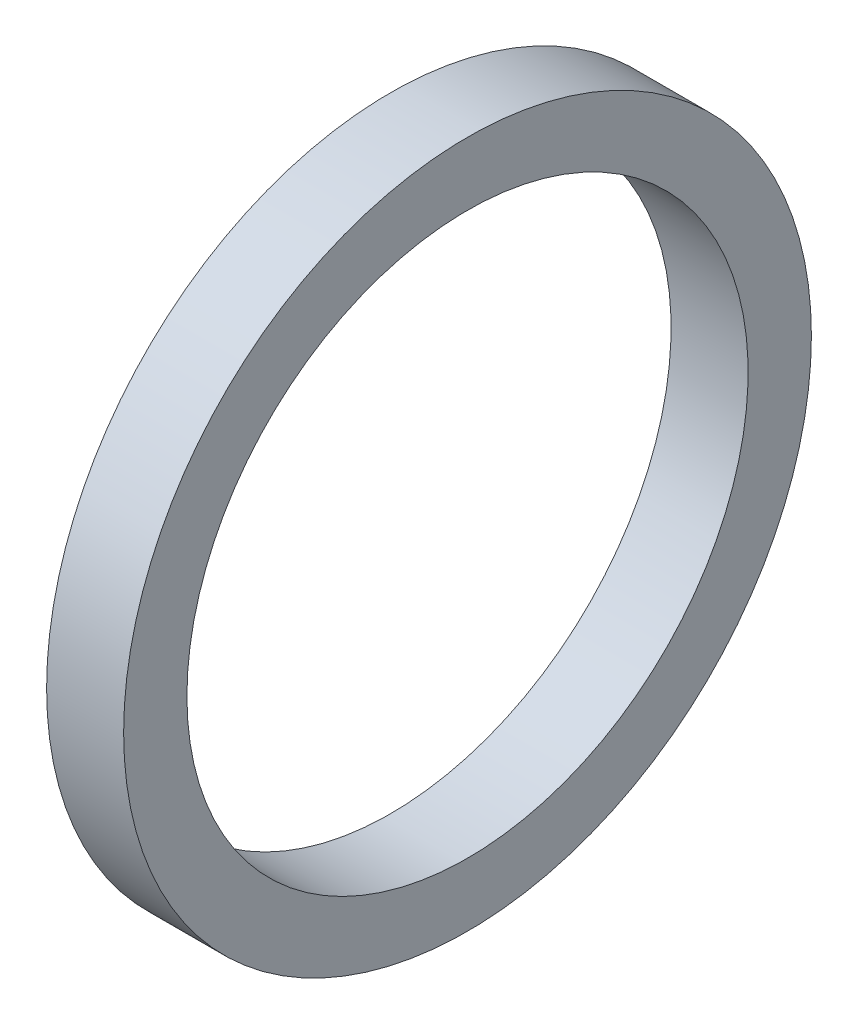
from build123d import *

# Parameters (mm, degrees)
SKETCH1_W = 14
SKETCH1_H = 11.5


with BuildPart() as part:
    # Sketch1 → Base-Revolve (revolve)
    with BuildSketch(Plane.XY, mode=Mode.PRIVATE) as base_revolve_sk:
        with Locations((-7, 56.75)):
            Rectangle(SKETCH1_W, SKETCH1_H)
    revolve(base_revolve_sk.sketch.rotate(Axis((-34.925, 0, 0), (1, 0, 0)), 90), axis=Axis((-34.925, 0, 0), (1, 0, 0)))


solid = part.part
